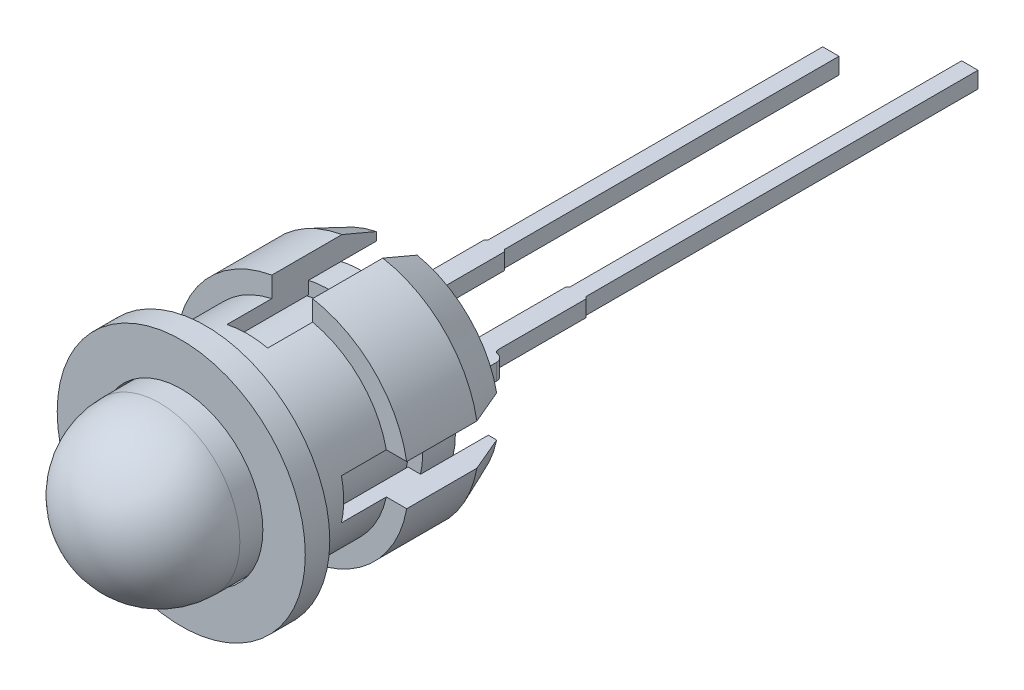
from build123d import *

# Parameters (mm, degrees)
EXTRUDE1_DEPTH          = 0.254
EXTRUDE1_DEPTH_BACK     = 0.254
CUT_EXTRUDE_THIN2_START = -27.675950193
SKETCH5_W               = 1.27
SKETCH5_H               = 8.860157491
CUT_EXTRUDE_THIN2_DEPTH = 31.231950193
CIRPATTERN2_COUNT       = 2
CIRPATTERN2_ANGLE       = 90
SKETCH6_W               = 4.463815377
SKETCH6_H               = 10.278839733
SKETCH6_W_2             = 2.798932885
SKETCH6_H_2             = 9.265432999
CUT_EXTRUDE1_DEPTH      = 1.27


with BuildPart() as part:
    # Sketch1 → Revolve1 (revolve)
    with BuildSketch(Plane(origin=(0, 0, 0), x_dir=(0, 0, -1), z_dir=(1, 0, 0)), mode=Mode.PRIVATE) as revolve1_sk:
        with BuildLine():
            Line((0, 0), (0, 2.921))
            Line((0, 2.921), (-1.016, 2.921))
            Line((-1.016, 2.921), (-1.016, 2.5))
            Line((-1.016, 2.5), (-6.2884, 2.5))
            ThreePointArc((-6.2884, 2.5), (-8.056166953, 1.767766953), (-8.7884, 0))
            Line((-8.7884, 0), (0, 0))
        make_face()
    revolve(revolve1_sk.sketch.rotate(Axis((0, 0, 68.7324), (0, 0, -1)), 90), axis=Axis((0, 0, 68.7324), (0, 0, -1)))

    # Sketch3 → Extrude1 (add, two sides: drawn at the far end of the back side and taken through both)
    with BuildSketch(Plane(origin=(0, 0, 0), x_dir=(1, 0, 0), z_dir=(0, 1, 0)).offset(-EXTRUDE1_DEPTH_BACK)):
        with BuildLine():
            Line((0.8382, 0), (1.7018, 0))
            Line((1.7018, 0), (1.7018, 1.740996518))
            ThreePointArc((1.7018, 1.740996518), (1.720043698, 1.806579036), (1.769533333, 1.853319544))
            ThreePointArc((1.769533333, 1.853319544), (1.868512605, 1.946800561), (1.905, 2.077965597))
            Line((1.905, 2.077965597), (1.905, 2.289552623))
            ThreePointArc((1.905, 2.289552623), (1.844995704, 2.453508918), (1.693333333, 2.54))
            ThreePointArc((1.693333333, 2.54), (1.617502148, 2.583245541), (1.5875, 2.665223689))
            Line((1.5875, 2.665223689), (1.5875, 5.3975))
            Line((1.5875, 5.3975), (1.524, 5.461))
            Line((1.524, 5.461), (1.524, 26.1112))
            Line((1.524, 26.1112), (1.016, 26.1112))
            Line((1.016, 26.1112), (1.016, 5.461))
            Line((1.016, 5.461), (0.9525, 5.3975))
            Line((0.9525, 5.3975), (0.9525, 2.665223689))
            ThreePointArc((0.9525, 2.665223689), (0.922497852, 2.583245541), (0.846666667, 2.54))
            ThreePointArc((0.846666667, 2.54), (0.695004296, 2.453508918), (0.635, 2.289552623))
            Line((0.635, 2.289552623), (0.635, 2.077965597))
            ThreePointArc((0.635, 2.077965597), (0.671487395, 1.946800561), (0.770466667, 1.853319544))
            ThreePointArc((0.770466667, 1.853319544), (0.819956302, 1.806579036), (0.8382, 1.740996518))
            Line((0.8382, 1.740996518), (0.8382, 0))
        make_face()
        with BuildLine():
            Line((-1.5875, 5.3975), (-1.524, 5.461))
            Line((-1.524, 5.461), (-1.524, 25.0444))
            Line((-1.524, 25.0444), (-1.016, 25.0444))
            Line((-1.016, 25.0444), (-1.016, 5.461))
            Line((-1.016, 5.461), (-0.9525, 5.3975))
            Line((-0.9525, 5.3975), (-0.9525, 2.665223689))
            ThreePointArc((-0.9525, 2.665223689), (-0.922497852, 2.583245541), (-0.846666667, 2.54))
            ThreePointArc((-0.846666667, 2.54), (-0.695004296, 2.453508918), (-0.635, 2.289552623))
            Line((-0.635, 2.289552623), (-0.635, 2.077965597))
            ThreePointArc((-0.635, 2.077965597), (-0.671487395, 1.946800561), (-0.770466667, 1.853319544))
            ThreePointArc((-0.770466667, 1.853319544), (-0.819956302, 1.806579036), (-0.8382, 1.740996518))
            Line((-0.8382, 1.740996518), (-0.8382, 0))
            Line((-0.8382, 0), (-1.7018, 0))
            Line((-1.7018, 0), (-1.7018, 1.740996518))
            ThreePointArc((-1.7018, 1.740996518), (-1.720043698, 1.806579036), (-1.769533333, 1.853319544))
            ThreePointArc((-1.769533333, 1.853319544), (-1.868512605, 1.946800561), (-1.905, 2.077965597))
            Line((-1.905, 2.077965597), (-1.905, 2.289552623))
            ThreePointArc((-1.905, 2.289552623), (-1.844995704, 2.453508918), (-1.693333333, 2.54))
            ThreePointArc((-1.693333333, 2.54), (-1.617502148, 2.583245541), (-1.5875, 2.665223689))
            Line((-1.5875, 2.665223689), (-1.5875, 5.3975))
        make_face()
    extrude(amount=EXTRUDE1_DEPTH + EXTRUDE1_DEPTH_BACK)

    # Sketch6 → Cut-Extrude1 (cut, symmetric)
    with BuildSketch(Plane(origin=(0, 0, 0), x_dir=(1, 0, 0), z_dir=(0, 1, 0))):
        with Locations((-2.231907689, 21.015310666)):
            Rectangle(SKETCH6_W, SKETCH6_H)
        with Locations((1.90616981, 22.294133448)):
            Rectangle(SKETCH6_W_2, SKETCH6_H_2)
    extrude(amount=CUT_EXTRUDE1_DEPTH, both=True, mode=Mode.SUBTRACT)


with BuildPart() as body_2:
    # Sketch4 → Revolve3 (revolve)
    with BuildSketch(Plane(origin=(0, 0, 0), x_dir=(0, 0, -1), z_dir=(1, 0, 0)), mode=Mode.PRIVATE) as revolve3_sk:
        Polygon((1.0922, 2.921), (-1.016, 2.921), (-1.016, 2.54), (-5.6134, 2.54), (-5.6134, 3.8608), (-4.8514, 3.8608), (-4.8514, 2.9972), (-2.159, 2.9972), (-2.159, 3.6195), (0.0254, 3.6195), (1.0922, 3.175), align=None)
    revolve(revolve3_sk.sketch.rotate(Axis((0, 0, 10.223161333), (0, 0, -1)), 90), axis=Axis((0, 0, 10.223161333), (0, 0, -1)))

    # Sketch5 → Cut-Extrude-Thin2 (cut)
    with BuildSketch(Plane.XY.offset(CUT_EXTRUDE_THIN2_START)):
        with Locations((0, -0.066617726)):
            Rectangle(SKETCH5_W, SKETCH5_H)
    cut_extrude_thin2 = extrude(amount=CUT_EXTRUDE_THIN2_DEPTH, mode=Mode.SUBTRACT)

    # CirPattern2: Cut-Extrude-Thin2 ×2 about axis
    cirpattern2_axis = Axis((0, 0, 68.7324), (0, 0, -1))
    for i in range(1, CIRPATTERN2_COUNT):
        add(cut_extrude_thin2.rotate(cirpattern2_axis, i * CIRPATTERN2_ANGLE / (CIRPATTERN2_COUNT - 1)), mode=Mode.SUBTRACT)


solid = Compound([part.part, body_2.part])
